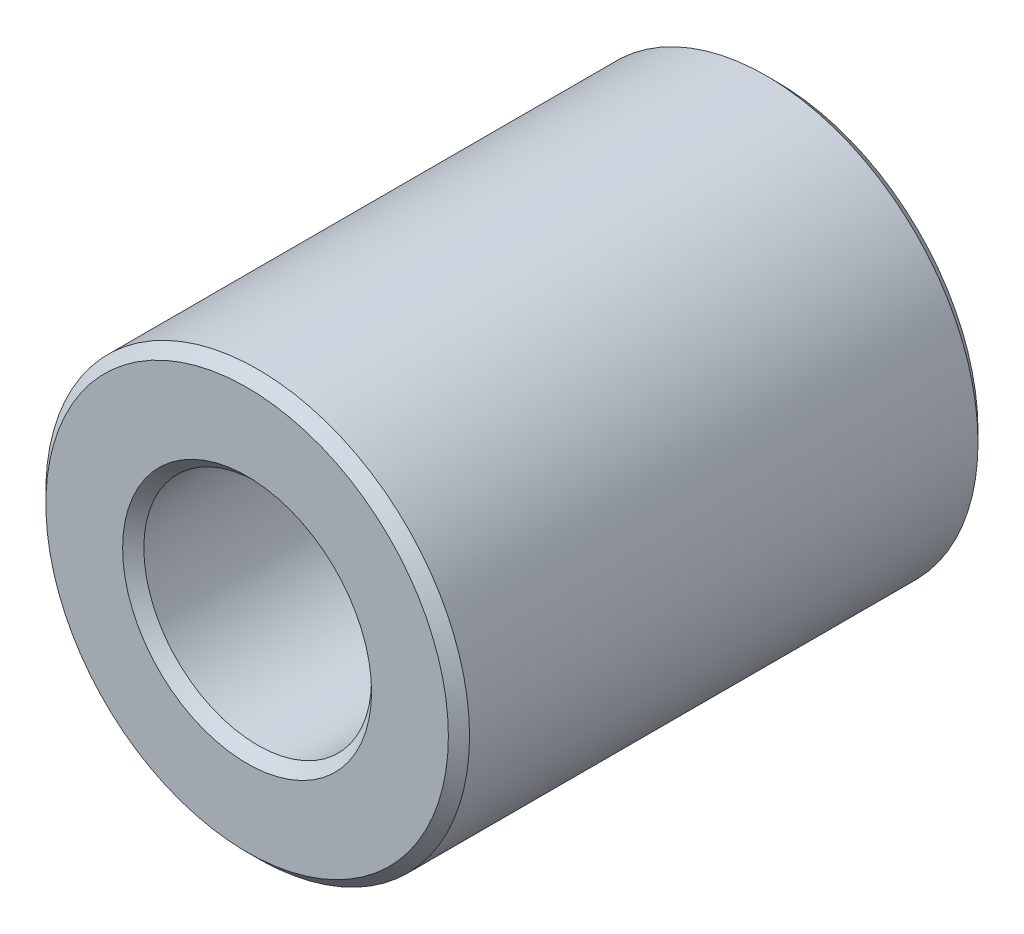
from build123d import *

# Parameters (mm, degrees)
SKETCH1_R           = 4
SKETCH1_R_2         = 2.15
BOSS_EXTRUDE2_DEPTH = 5
CHAMFER3_SIZE       = 0.2


with BuildPart() as part:
    # Sketch1 → Boss-Extrude2 (new, symmetric)
    with BuildSketch(Plane.XY):
        Circle(SKETCH1_R)
        Circle(SKETCH1_R_2, mode=Mode.SUBTRACT)
    extrude(amount=BOSS_EXTRUDE2_DEPTH, both=True)

    # Chamfer3
    chamfer3_edges = [part.edges().sort_by_distance(p)[0] for p in [
        (-4, 0, -5),
        (-4, 0, 5),
        (-2.15, 0, -5),
        (-2.15, 0, 5),
    ]]
    chamfer(chamfer3_edges, length=CHAMFER3_SIZE)


solid = part.part
